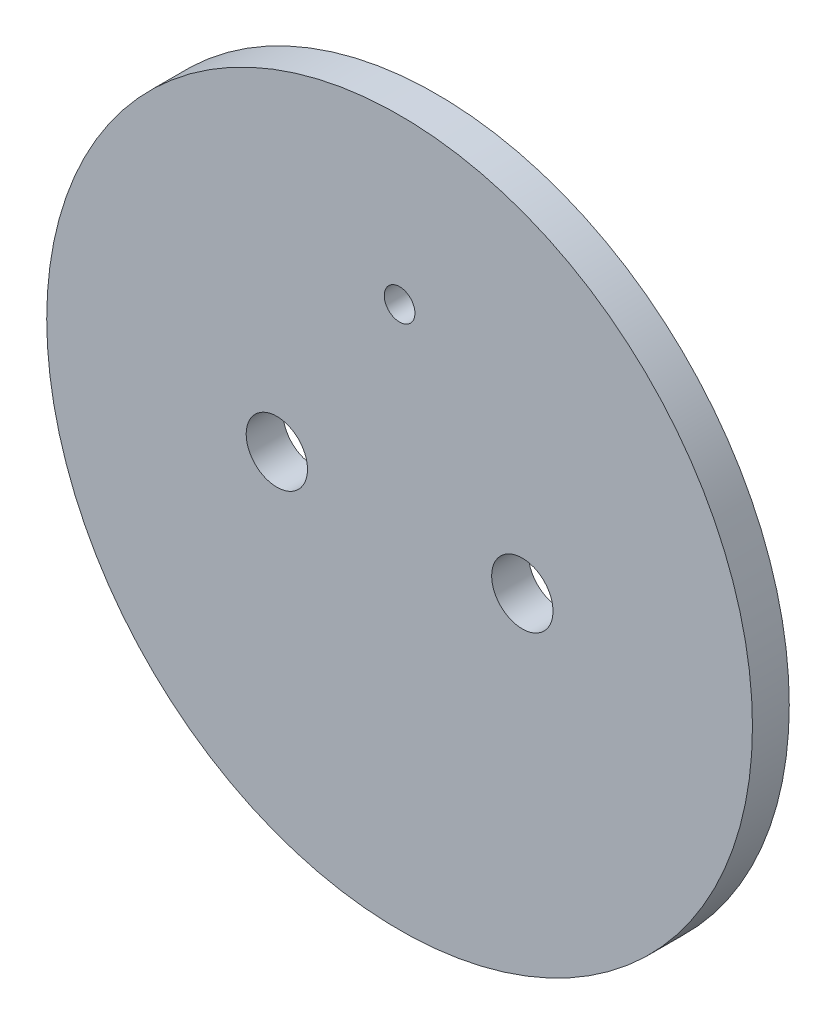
from build123d import *

# Parameters (mm, degrees)
SKETCH1_R          = 36.5125
EXTRUDE1_DEPTH     = 3.81
SKETCH2_R          = 1.5875
SKETCH2_R_2        = 3.175
CUT_EXTRUDE1_DEPTH = 52.776842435


with BuildPart() as part:
    # Sketch1 → Extrude1 (new body)
    with BuildSketch(Plane.XY):
        with Locations(Location((0, 0, 0), (0, 0, 180))):
            Circle(SKETCH1_R)
    extrude(amount=EXTRUDE1_DEPTH)

    # Sketch2 → Cut-Extrude1 (cut, through all)
    with BuildSketch(Plane.XY):
        with Locations(Location((0, 19.558, 0), (0, 0, 180))):
            Circle(SKETCH2_R)
        with Locations(Location((12.7, 0, 0), (0, 0, 180))):
            Circle(SKETCH2_R_2)
        with Locations(Location((-12.7, 0, 0), (0, 0, 180))):
            Circle(SKETCH2_R_2)
    extrude(amount=CUT_EXTRUDE1_DEPTH, mode=Mode.SUBTRACT)


solid = part.part
